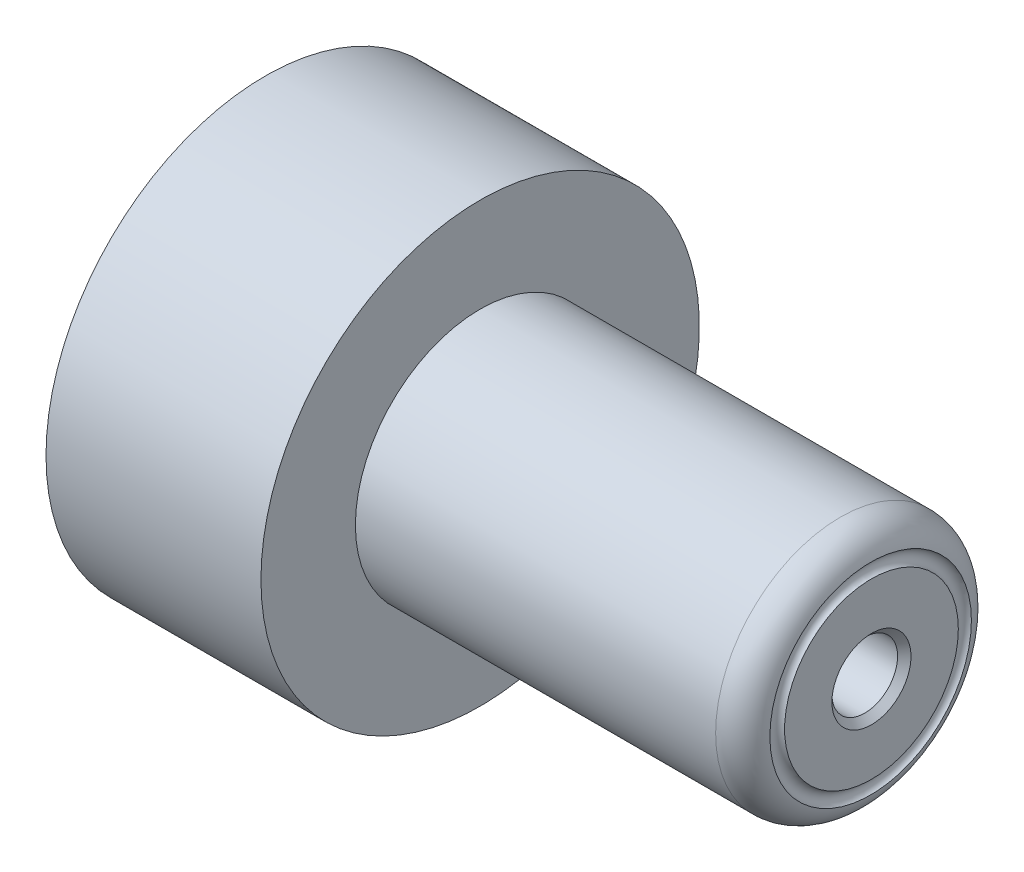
ISO-10303-21;
HEADER;
FILE_DESCRIPTION(('STEP AP214'),'2;1');
FILE_NAME('part.step','',(''),(''),'','','');
FILE_SCHEMA(('AUTOMOTIVE_DESIGN { 1 0 10303 214 1 1 1 1 }'));
ENDSEC;
DATA;
#1=APPLICATION_CONTEXT('core data for automotive mechanical design processes');
#2=APPLICATION_PROTOCOL_DEFINITION('international standard','automotive_design',2000,#1);
#3=PRODUCT_CONTEXT('',#1,'mechanical');
#4=PRODUCT('Part','Part','',(#3));
#5=PRODUCT_RELATED_PRODUCT_CATEGORY('part','',(#4));
#6=PRODUCT_DEFINITION_FORMATION('','',#4);
#7=PRODUCT_DEFINITION_CONTEXT('part definition',#1,'design');
#8=PRODUCT_DEFINITION('design','',#6,#7);
#9=PRODUCT_DEFINITION_SHAPE('','',#8);
#10=(LENGTH_UNIT() NAMED_UNIT(*) SI_UNIT(.MILLI.,.METRE.));
#11=(NAMED_UNIT(*) PLANE_ANGLE_UNIT() SI_UNIT($,.RADIAN.));
#12=(NAMED_UNIT(*) SI_UNIT($,.STERADIAN.) SOLID_ANGLE_UNIT());
#13=UNCERTAINTY_MEASURE_WITH_UNIT(LENGTH_MEASURE(1.E-05),#10,'distance_accuracy_value','');
#14=(GEOMETRIC_REPRESENTATION_CONTEXT(3) GLOBAL_UNCERTAINTY_ASSIGNED_CONTEXT((#13)) GLOBAL_UNIT_ASSIGNED_CONTEXT((#10,
#11,#12)) REPRESENTATION_CONTEXT('',''));
#15=CARTESIAN_POINT('',(0.,0.,0.));
#16=DIRECTION('',(0.,0.,1.));
#17=DIRECTION('',(1.,0.,0.));
#18=AXIS2_PLACEMENT_3D('',#15,#16,#17);
#19=CARTESIAN_POINT('',(30.734,4.7498,0.));
#20=DIRECTION('',(-1.,0.,0.));
#21=DIRECTION('',(0.,0.,1.));
#22=AXIS2_PLACEMENT_3D('',#19,#20,#21);
#23=PLANE('',#22);
#24=CARTESIAN_POINT('',(30.734,0.,0.));
#25=DIRECTION('',(-1.,0.,0.));
#26=DIRECTION('',(0.,0.,1.));
#27=AXIS2_PLACEMENT_3D('',#24,#25,#26);
#28=CIRCLE('',#27,2.00500000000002);
#29=CARTESIAN_POINT('',(30.734,0.,2.00500000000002));
#30=VERTEX_POINT('',#29);
#31=EDGE_CURVE('E10',#30,#30,#28,.T.);
#32=ORIENTED_EDGE('',*,*,#31,.T.);
#33=EDGE_LOOP('',(#32));
#34=FACE_BOUND('',#33,.T.);
#35=CARTESIAN_POINT('',(30.734,0.,0.));
#36=DIRECTION('',(1.,0.,0.));
#37=DIRECTION('',(0.,0.,-1.));
#38=AXIS2_PLACEMENT_3D('',#35,#36,#37);
#39=CIRCLE('',#38,4.4044004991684);
#40=CARTESIAN_POINT('',(30.734,0.,-4.4044004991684));
#41=VERTEX_POINT('',#40);
#42=EDGE_CURVE('E78',#41,#41,#39,.F.);
#43=ORIENTED_EDGE('',*,*,#42,.F.);
#44=EDGE_LOOP('',(#43));
#45=FACE_BOUND('',#44,.T.);
#46=ADVANCED_FACE('F31',(#34,#45),#23,.F.);
#47=CARTESIAN_POINT('',(29.1592,0.,0.));
#48=DIRECTION('',(-1.,0.,0.));
#49=DIRECTION('',(0.,0.,1.));
#50=AXIS2_PLACEMENT_3D('',#47,#48,#49);
#51=TOROIDAL_SURFACE('',#50,4.7498,1.5748);
#52=CARTESIAN_POINT('',(29.1592,0.,0.));
#53=DIRECTION('',(-1.,0.,0.));
#54=DIRECTION('',(0.,0.,1.));
#55=AXIS2_PLACEMENT_3D('',#52,#53,#54);
#56=CIRCLE('',#55,6.3246);
#57=CARTESIAN_POINT('',(29.1592,0.,6.3246));
#58=VERTEX_POINT('',#57);
#59=EDGE_CURVE('E48',#58,#58,#56,.T.);
#60=ORIENTED_EDGE('',*,*,#59,.F.);
#61=EDGE_LOOP('',(#60));
#62=FACE_BOUND('',#61,.T.);
#63=CARTESIAN_POINT('',(30.6925607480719,0.,0.));
#64=DIRECTION('',(1.,0.,0.));
#65=DIRECTION('',(0.,0.,-1.));
#66=AXIS2_PLACEMENT_3D('',#63,#64,#65);
#67=CIRCLE('',#66,5.10868696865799);
#68=CARTESIAN_POINT('',(30.6925607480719,0.,-5.10868696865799));
#69=VERTEX_POINT('',#68);
#70=EDGE_CURVE('E35',#69,#69,#67,.T.);
#71=ORIENTED_EDGE('',*,*,#70,.F.);
#72=EDGE_LOOP('',(#71));
#73=FACE_BOUND('',#72,.T.);
#74=ADVANCED_FACE('F87',(#62,#73),#51,.T.);
#75=CARTESIAN_POINT('',(0.,0.,0.));
#76=DIRECTION('',(-1.,0.,0.));
#77=DIRECTION('',(0.,0.,1.));
#78=AXIS2_PLACEMENT_3D('',#75,#76,#77);
#79=CYLINDRICAL_SURFACE('',#78,3.9751);
#80=CARTESIAN_POINT('',(21.8948,0.,0.));
#81=DIRECTION('',(-1.,0.,0.));
#82=DIRECTION('',(0.,0.,1.));
#83=AXIS2_PLACEMENT_3D('',#80,#81,#82);
#84=CIRCLE('',#83,3.9751);
#85=CARTESIAN_POINT('',(21.8948,0.,3.9751));
#86=VERTEX_POINT('',#85);
#87=EDGE_CURVE('E43',#86,#86,#84,.T.);
#88=ORIENTED_EDGE('',*,*,#87,.F.);
#89=EDGE_LOOP('',(#88));
#90=FACE_BOUND('',#89,.T.);
#91=CARTESIAN_POINT('',(0.,0.,0.));
#92=DIRECTION('',(-1.,0.,0.));
#93=DIRECTION('',(0.,0.,1.));
#94=AXIS2_PLACEMENT_3D('',#91,#92,#93);
#95=CIRCLE('',#94,3.9751);
#96=CARTESIAN_POINT('',(0.,0.,3.9751));
#97=VERTEX_POINT('',#96);
#98=EDGE_CURVE('E60',#97,#97,#95,.T.);
#99=ORIENTED_EDGE('',*,*,#98,.T.);
#100=EDGE_LOOP('',(#99));
#101=FACE_BOUND('',#100,.T.);
#102=ADVANCED_FACE('F89',(#90,#101),#79,.F.);
#103=CARTESIAN_POINT('',(21.8948,3.9751,0.));
#104=DIRECTION('',(1.,0.,0.));
#105=DIRECTION('',(0.,0.,-1.));
#106=AXIS2_PLACEMENT_3D('',#103,#104,#105);
#107=PLANE('',#106);
#108=CARTESIAN_POINT('',(21.8948,0.,0.));
#109=DIRECTION('',(1.,0.,0.));
#110=DIRECTION('',(0.,0.,-1.));
#111=AXIS2_PLACEMENT_3D('',#108,#109,#110);
#112=CIRCLE('',#111,1.665);
#113=CARTESIAN_POINT('',(21.8948,0.,-1.665));
#114=VERTEX_POINT('',#113);
#115=EDGE_CURVE('E73',#114,#114,#112,.T.);
#116=ORIENTED_EDGE('',*,*,#115,.T.);
#117=EDGE_LOOP('',(#116));
#118=FACE_BOUND('',#117,.T.);
#119=ORIENTED_EDGE('',*,*,#87,.T.);
#120=EDGE_LOOP('',(#119));
#121=FACE_BOUND('',#120,.T.);
#122=ADVANCED_FACE('F96',(#118,#121),#107,.F.);
#123=CARTESIAN_POINT('',(0.,0.,0.));
#124=DIRECTION('',(-1.,0.,0.));
#125=DIRECTION('',(0.,0.,1.));
#126=AXIS2_PLACEMENT_3D('',#123,#124,#125);
#127=CYLINDRICAL_SURFACE('',#126,6.3246);
#128=CARTESIAN_POINT('',(10.8966,0.,0.));
#129=DIRECTION('',(-1.,0.,0.));
#130=DIRECTION('',(0.,0.,1.));
#131=AXIS2_PLACEMENT_3D('',#128,#129,#130);
#132=CIRCLE('',#131,6.3246);
#133=CARTESIAN_POINT('',(10.8966,0.,6.3246));
#134=VERTEX_POINT('',#133);
#135=EDGE_CURVE('E51',#134,#134,#132,.T.);
#136=ORIENTED_EDGE('',*,*,#135,.F.);
#137=EDGE_LOOP('',(#136));
#138=FACE_BOUND('',#137,.T.);
#139=ORIENTED_EDGE('',*,*,#59,.T.);
#140=EDGE_LOOP('',(#139));
#141=FACE_BOUND('',#140,.T.);
#142=ADVANCED_FACE('F101',(#138,#141),#127,.T.);
#143=CARTESIAN_POINT('',(10.8966,11.1125,0.));
#144=DIRECTION('',(-1.,0.,0.));
#145=DIRECTION('',(0.,0.,1.));
#146=AXIS2_PLACEMENT_3D('',#143,#144,#145);
#147=PLANE('',#146);
#148=CARTESIAN_POINT('',(10.8966,0.,0.));
#149=DIRECTION('',(-1.,0.,0.));
#150=DIRECTION('',(0.,0.,1.));
#151=AXIS2_PLACEMENT_3D('',#148,#149,#150);
#152=CIRCLE('',#151,11.1125);
#153=CARTESIAN_POINT('',(10.8966,0.,11.1125));
#154=VERTEX_POINT('',#153);
#155=EDGE_CURVE('E54',#154,#154,#152,.T.);
#156=ORIENTED_EDGE('',*,*,#155,.F.);
#157=EDGE_LOOP('',(#156));
#158=FACE_BOUND('',#157,.T.);
#159=ORIENTED_EDGE('',*,*,#135,.T.);
#160=EDGE_LOOP('',(#159));
#161=FACE_BOUND('',#160,.T.);
#162=ADVANCED_FACE('F109',(#158,#161),#147,.F.);
#163=CARTESIAN_POINT('',(0.,0.,0.));
#164=DIRECTION('',(-1.,0.,0.));
#165=DIRECTION('',(0.,0.,1.));
#166=AXIS2_PLACEMENT_3D('',#163,#164,#165);
#167=CYLINDRICAL_SURFACE('',#166,11.1125);
#168=CARTESIAN_POINT('',(0.,0.,0.));
#169=DIRECTION('',(-1.,0.,0.));
#170=DIRECTION('',(0.,0.,1.));
#171=AXIS2_PLACEMENT_3D('',#168,#169,#170);
#172=CIRCLE('',#171,11.1125);
#173=CARTESIAN_POINT('',(0.,0.,11.1125));
#174=VERTEX_POINT('',#173);
#175=EDGE_CURVE('E57',#174,#174,#172,.T.);
#176=ORIENTED_EDGE('',*,*,#175,.F.);
#177=EDGE_LOOP('',(#176));
#178=FACE_BOUND('',#177,.T.);
#179=ORIENTED_EDGE('',*,*,#155,.T.);
#180=EDGE_LOOP('',(#179));
#181=FACE_BOUND('',#180,.T.);
#182=ADVANCED_FACE('F121',(#178,#181),#167,.T.);
#183=CARTESIAN_POINT('',(0.,3.9751,0.));
#184=DIRECTION('',(1.,0.,0.));
#185=DIRECTION('',(0.,0.,-1.));
#186=AXIS2_PLACEMENT_3D('',#183,#184,#185);
#187=PLANE('',#186);
#188=CARTESIAN_POINT('',(0.,0.,6.7437));
#189=DIRECTION('',(-1.,0.,0.));
#190=DIRECTION('',(0.,0.,-1.));
#191=AXIS2_PLACEMENT_3D('',#188,#189,#190);
#192=CIRCLE('',#191,1.2065);
#193=CARTESIAN_POINT('',(0.,0.,5.5372));
#194=VERTEX_POINT('',#193);
#195=EDGE_CURVE('E70',#194,#194,#192,.T.);
#196=ORIENTED_EDGE('',*,*,#195,.F.);
#197=EDGE_LOOP('',(#196));
#198=FACE_BOUND('',#197,.T.);
#199=CARTESIAN_POINT('',(0.,0.,-6.7437));
#200=DIRECTION('',(-1.,0.,0.));
#201=DIRECTION('',(0.,0.,1.));
#202=AXIS2_PLACEMENT_3D('',#199,#200,#201);
#203=CIRCLE('',#202,1.2065);
#204=CARTESIAN_POINT('',(0.,0.,-5.5372));
#205=VERTEX_POINT('',#204);
#206=EDGE_CURVE('E64',#205,#205,#203,.T.);
#207=ORIENTED_EDGE('',*,*,#206,.F.);
#208=EDGE_LOOP('',(#207));
#209=FACE_BOUND('',#208,.T.);
#210=ORIENTED_EDGE('',*,*,#98,.F.);
#211=EDGE_LOOP('',(#210));
#212=FACE_BOUND('',#211,.T.);
#213=ORIENTED_EDGE('',*,*,#175,.T.);
#214=EDGE_LOOP('',(#213));
#215=FACE_BOUND('',#214,.T.);
#216=ADVANCED_FACE('F117',(#198,#209,#212,#215),#187,.F.);
#217=CARTESIAN_POINT('',(2.54,0.,-6.7437));
#218=DIRECTION('',(-1.,0.,0.));
#219=DIRECTION('',(0.,0.,1.));
#220=AXIS2_PLACEMENT_3D('',#217,#218,#219);
#221=CYLINDRICAL_SURFACE('',#220,1.2065);
#222=CARTESIAN_POINT('',(2.54,0.,-6.7437));
#223=DIRECTION('',(-1.,0.,0.));
#224=DIRECTION('',(0.,0.,1.));
#225=AXIS2_PLACEMENT_3D('',#222,#223,#224);
#226=CIRCLE('',#225,1.2065);
#227=CARTESIAN_POINT('',(2.54,0.,-5.5372));
#228=VERTEX_POINT('',#227);
#229=EDGE_CURVE('E63',#228,#228,#226,.T.);
#230=ORIENTED_EDGE('',*,*,#229,.F.);
#231=EDGE_LOOP('',(#230));
#232=FACE_BOUND('',#231,.T.);
#233=ORIENTED_EDGE('',*,*,#206,.T.);
#234=EDGE_LOOP('',(#233));
#235=FACE_BOUND('',#234,.T.);
#236=ADVANCED_FACE('F120',(#232,#235),#221,.F.);
#237=CARTESIAN_POINT('',(2.54,0.,-6.7437));
#238=DIRECTION('',(-1.,0.,0.));
#239=DIRECTION('',(0.,0.,1.));
#240=AXIS2_PLACEMENT_3D('',#237,#238,#239);
#241=PLANE('',#240);
#242=ORIENTED_EDGE('',*,*,#229,.T.);
#243=EDGE_LOOP('',(#242));
#244=FACE_BOUND('',#243,.T.);
#245=ADVANCED_FACE('F140',(#244),#241,.T.);
#246=CARTESIAN_POINT('',(2.54,0.,6.7437));
#247=DIRECTION('',(-1.,0.,0.));
#248=DIRECTION('',(0.,0.,1.));
#249=AXIS2_PLACEMENT_3D('',#246,#247,#248);
#250=CYLINDRICAL_SURFACE('',#249,1.2065);
#251=CARTESIAN_POINT('',(2.54,0.,6.7437));
#252=DIRECTION('',(-1.,0.,0.));
#253=DIRECTION('',(0.,0.,-1.));
#254=AXIS2_PLACEMENT_3D('',#251,#252,#253);
#255=CIRCLE('',#254,1.2065);
#256=CARTESIAN_POINT('',(2.54,0.,5.5372));
#257=VERTEX_POINT('',#256);
#258=EDGE_CURVE('E67',#257,#257,#255,.T.);
#259=ORIENTED_EDGE('',*,*,#258,.F.);
#260=EDGE_LOOP('',(#259));
#261=FACE_BOUND('',#260,.T.);
#262=ORIENTED_EDGE('',*,*,#195,.T.);
#263=EDGE_LOOP('',(#262));
#264=FACE_BOUND('',#263,.T.);
#265=ADVANCED_FACE('F144',(#261,#264),#250,.F.);
#266=CARTESIAN_POINT('',(2.54,0.,6.7437));
#267=DIRECTION('',(1.,0.,0.));
#268=DIRECTION('',(0.,0.,-1.));
#269=AXIS2_PLACEMENT_3D('',#266,#267,#268);
#270=PLANE('',#269);
#271=ORIENTED_EDGE('',*,*,#258,.T.);
#272=EDGE_LOOP('',(#271));
#273=FACE_BOUND('',#272,.T.);
#274=ADVANCED_FACE('F148',(#273),#270,.F.);
#275=CARTESIAN_POINT('',(0.,0.,0.));
#276=DIRECTION('',(1.,0.,0.));
#277=DIRECTION('',(0.,0.,-1.));
#278=AXIS2_PLACEMENT_3D('',#275,#276,#277);
#279=CYLINDRICAL_SURFACE('',#278,1.665);
#280=CARTESIAN_POINT('',(30.394,0.,0.));
#281=DIRECTION('',(-1.,0.,0.));
#282=DIRECTION('',(0.,0.,1.));
#283=AXIS2_PLACEMENT_3D('',#280,#281,#282);
#284=CIRCLE('',#283,1.665);
#285=CARTESIAN_POINT('',(30.394,0.,1.665));
#286=VERTEX_POINT('',#285);
#287=EDGE_CURVE('E39',#286,#286,#284,.F.);
#288=ORIENTED_EDGE('',*,*,#287,.T.);
#289=EDGE_LOOP('',(#288));
#290=FACE_BOUND('',#289,.T.);
#291=ORIENTED_EDGE('',*,*,#115,.F.);
#292=EDGE_LOOP('',(#291));
#293=FACE_BOUND('',#292,.T.);
#294=ADVANCED_FACE('F152',(#290,#293),#279,.F.);
#295=CARTESIAN_POINT('',(30.394,0.,0.));
#296=DIRECTION('',(1.,0.,0.));
#297=DIRECTION('',(0.,0.,-1.));
#298=AXIS2_PLACEMENT_3D('',#295,#296,#297);
#299=CONICAL_SURFACE('',#298,1.665,0.785398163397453);
#300=ORIENTED_EDGE('',*,*,#31,.F.);
#301=EDGE_LOOP('',(#300));
#302=FACE_BOUND('',#301,.T.);
#303=ORIENTED_EDGE('',*,*,#287,.F.);
#304=EDGE_LOOP('',(#303));
#305=FACE_BOUND('',#304,.T.);
#306=ADVANCED_FACE('F33',(#302,#305),#299,.F.);
#307=CARTESIAN_POINT('',(30.857,0.,0.));
#308=DIRECTION('',(-1.,0.,0.));
#309=DIRECTION('',(0.,0.,1.));
#310=AXIS2_PLACEMENT_3D('',#307,#308,#309);
#311=TOROIDAL_SURFACE('',#310,4.765,0.380999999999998);
#312=ORIENTED_EDGE('',*,*,#70,.T.);
#313=EDGE_LOOP('',(#312));
#314=FACE_BOUND('',#313,.T.);
#315=ORIENTED_EDGE('',*,*,#42,.T.);
#316=EDGE_LOOP('',(#315));
#317=FACE_BOUND('',#316,.T.);
#318=ADVANCED_FACE('F85',(#314,#317),#311,.F.);
#319=CLOSED_SHELL('',(#46,#74,#102,#122,#142,#162,#182,#216,#236,#245,#265,#274,#294,#306,#318));
#320=MANIFOLD_SOLID_BREP('B2',#319);
#321=ADVANCED_BREP_SHAPE_REPRESENTATION('',(#18,#320),#14);
#322=SHAPE_DEFINITION_REPRESENTATION(#9,#321);
ENDSEC;
END-ISO-10303-21;
